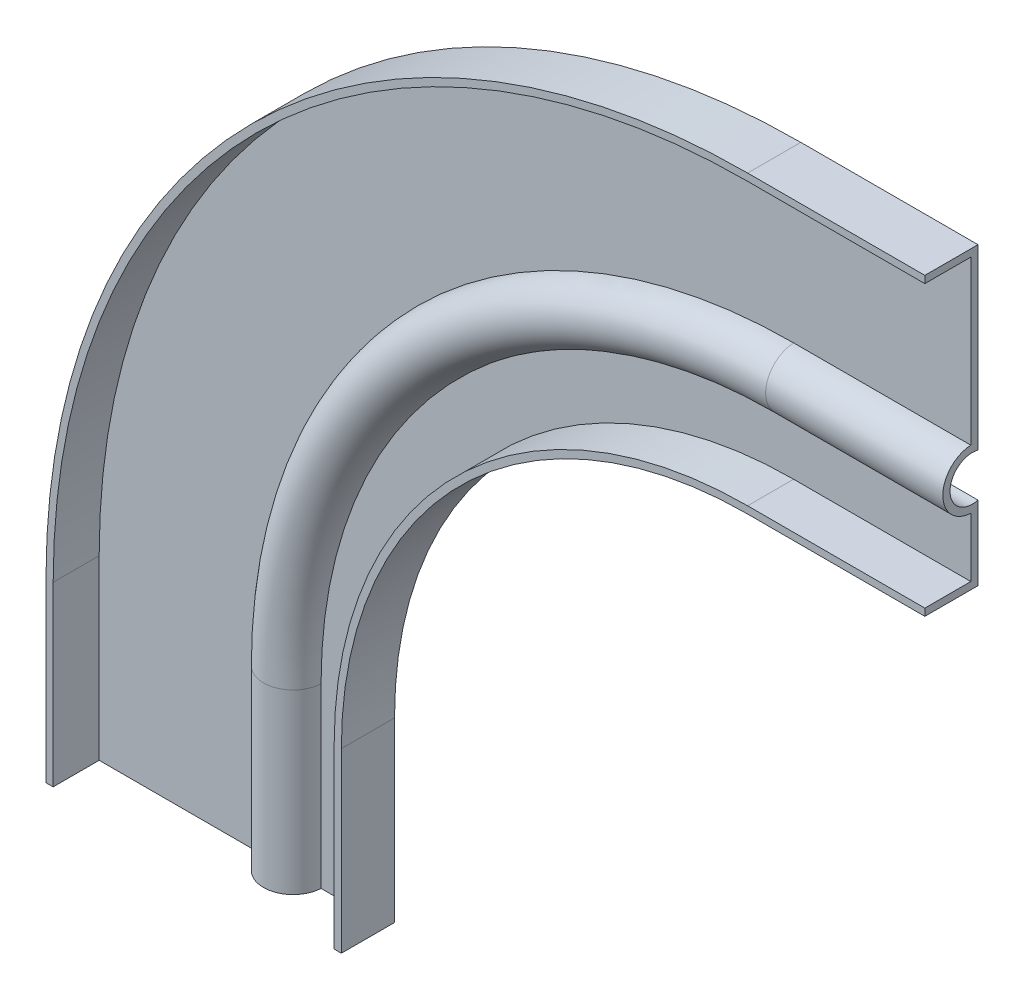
from build123d import *


with BuildPart() as part:
    # Sweep1: sweep along a path in Sketch1
    with BuildLine(Plane.XY) as sweep1_path:
        Line((100, 100), (70, 100))
        ThreePointArc((70, 100), (20.502525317, 79.497474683), (0, 30))
        Line((0, 30), (0, 0))
    # Sketch4 → Sweep1 (sweep)
    with BuildSketch(Plane(origin=(0, 0, 0), x_dir=(1, 0, 0), z_dir=(0, 1, 0))):
        with BuildLine():
            Line((0, 0), (0, -7.786))
            Line((0, -7.786), (1.214, -7.786))
            Line((1.214, -7.786), (1.214, 1.214))
            Line((1.214, 1.214), (-11.335757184, 1.214))
            ThreePointArc((-11.335757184, 1.214), (-15, -3.524428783), (-18.664242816, 1.214))
            Line((-18.664242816, 1.214), (-48.786, 1.214))
            Line((-48.786, 1.214), (-48.786, -7.786))
            Line((-48.786, -7.786), (-47.572, -7.786))
            Line((-47.572, -7.786), (-47.572, 0))
            Line((-47.572, 0), (-19.993153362, 0))
            ThreePointArc((-19.993153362, 0), (-15, -4.738428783), (-10.006846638, 0))
            Line((-10.006846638, 0), (0, 0))
        make_face()
    sweep(path=sweep1_path.line)


solid = part.part
